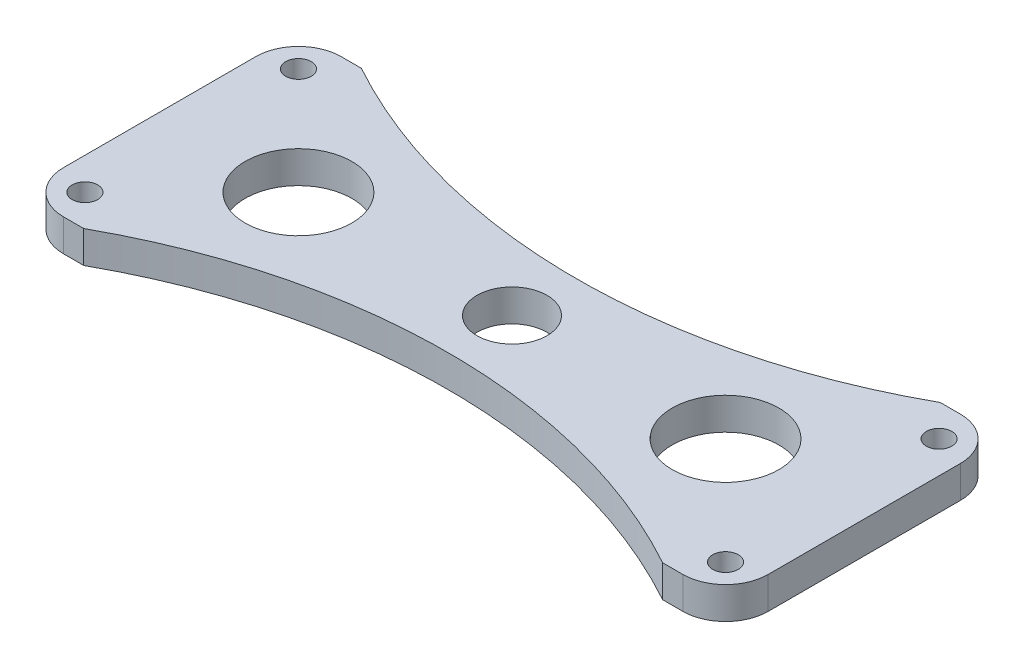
ISO-10303-21;
HEADER;
FILE_DESCRIPTION(('STEP AP214'),'2;1');
FILE_NAME('part.step','',(''),(''),'','','');
FILE_SCHEMA(('AUTOMOTIVE_DESIGN { 1 0 10303 214 1 1 1 1 }'));
ENDSEC;
DATA;
#1=APPLICATION_CONTEXT('core data for automotive mechanical design processes');
#2=APPLICATION_PROTOCOL_DEFINITION('international standard','automotive_design',2000,#1);
#3=PRODUCT_CONTEXT('',#1,'mechanical');
#4=PRODUCT('Part','Part','',(#3));
#5=PRODUCT_RELATED_PRODUCT_CATEGORY('part','',(#4));
#6=PRODUCT_DEFINITION_FORMATION('','',#4);
#7=PRODUCT_DEFINITION_CONTEXT('part definition',#1,'design');
#8=PRODUCT_DEFINITION('design','',#6,#7);
#9=PRODUCT_DEFINITION_SHAPE('','',#8);
#10=(LENGTH_UNIT() NAMED_UNIT(*) SI_UNIT(.MILLI.,.METRE.));
#11=(NAMED_UNIT(*) PLANE_ANGLE_UNIT() SI_UNIT($,.RADIAN.));
#12=(NAMED_UNIT(*) SI_UNIT($,.STERADIAN.) SOLID_ANGLE_UNIT());
#13=UNCERTAINTY_MEASURE_WITH_UNIT(LENGTH_MEASURE(1.E-05),#10,'distance_accuracy_value','');
#14=(GEOMETRIC_REPRESENTATION_CONTEXT(3) GLOBAL_UNCERTAINTY_ASSIGNED_CONTEXT((#13)) GLOBAL_UNIT_ASSIGNED_CONTEXT((#10,
#11,#12)) REPRESENTATION_CONTEXT('',''));
#15=CARTESIAN_POINT('',(0.,0.,0.));
#16=DIRECTION('',(0.,0.,1.));
#17=DIRECTION('',(1.,0.,0.));
#18=AXIS2_PLACEMENT_3D('',#15,#16,#17);
#19=CARTESIAN_POINT('',(-52.3875,4.7625,-20.6375));
#20=DIRECTION('',(0.,0.,1.));
#21=DIRECTION('',(1.,0.,0.));
#22=AXIS2_PLACEMENT_3D('',#19,#20,#21);
#23=PLANE('',#22);
#24=DIRECTION('',(-1.,0.,0.));
#25=VECTOR('',#24,1.);
#26=CARTESIAN_POINT('',(-52.3875,0.,-20.6375));
#27=LINE('',#26,#25);
#28=CARTESIAN_POINT('',(46.0375000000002,0.,-20.6375));
#29=VERTEX_POINT('',#28);
#30=CARTESIAN_POINT('',(43.0385274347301,0.,-20.6375));
#31=VERTEX_POINT('',#30);
#32=EDGE_CURVE('E213',#29,#31,#27,.T.);
#33=ORIENTED_EDGE('',*,*,#32,.T.);
#34=DIRECTION('',(0.,1.,0.));
#35=VECTOR('',#34,1.);
#36=CARTESIAN_POINT('',(43.0385274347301,0.,-20.6375000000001));
#37=LINE('',#36,#35);
#38=CARTESIAN_POINT('',(43.0385274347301,4.7625,-20.6375));
#39=VERTEX_POINT('',#38);
#40=EDGE_CURVE('E13',#31,#39,#37,.T.);
#41=ORIENTED_EDGE('',*,*,#40,.T.);
#42=DIRECTION('',(-1.,0.,0.));
#43=VECTOR('',#42,1.);
#44=CARTESIAN_POINT('',(-52.3875,4.7625,-20.6375));
#45=LINE('',#44,#43);
#46=CARTESIAN_POINT('',(46.0375000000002,4.7625,-20.6375));
#47=VERTEX_POINT('',#46);
#48=EDGE_CURVE('E141',#47,#39,#45,.T.);
#49=ORIENTED_EDGE('',*,*,#48,.F.);
#50=DIRECTION('',(0.,-1.,0.));
#51=VECTOR('',#50,1.);
#52=CARTESIAN_POINT('',(46.0375000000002,4.7625,-20.6375));
#53=LINE('',#52,#51);
#54=EDGE_CURVE('E170',#47,#29,#53,.T.);
#55=ORIENTED_EDGE('',*,*,#54,.T.);
#56=EDGE_LOOP('',(#33,#41,#49,#55));
#57=FACE_BOUND('',#56,.T.);
#58=ADVANCED_FACE('F41',(#57),#23,.F.);
#59=CARTESIAN_POINT('',(-52.3875000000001,4.7625,20.6375));
#60=DIRECTION('',(0.,0.,-1.));
#61=DIRECTION('',(-1.,0.,0.));
#62=AXIS2_PLACEMENT_3D('',#59,#60,#61);
#63=PLANE('',#62);
#64=DIRECTION('',(1.,0.,0.));
#65=VECTOR('',#64,1.);
#66=CARTESIAN_POINT('',(-52.3875000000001,0.,20.6375));
#67=LINE('',#66,#65);
#68=CARTESIAN_POINT('',(-46.0375000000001,0.,20.6375));
#69=VERTEX_POINT('',#68);
#70=CARTESIAN_POINT('',(-43.0385274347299,0.,20.6375));
#71=VERTEX_POINT('',#70);
#72=EDGE_CURVE('E203',#69,#71,#67,.T.);
#73=ORIENTED_EDGE('',*,*,#72,.T.);
#74=DIRECTION('',(0.,1.,0.));
#75=VECTOR('',#74,1.);
#76=CARTESIAN_POINT('',(-43.03852743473,0.,20.6375));
#77=LINE('',#76,#75);
#78=CARTESIAN_POINT('',(-43.0385274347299,4.7625,20.6375));
#79=VERTEX_POINT('',#78);
#80=EDGE_CURVE('E133',#71,#79,#77,.T.);
#81=ORIENTED_EDGE('',*,*,#80,.T.);
#82=DIRECTION('',(1.,0.,0.));
#83=VECTOR('',#82,1.);
#84=CARTESIAN_POINT('',(-52.3875000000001,4.7625,20.6375));
#85=LINE('',#84,#83);
#86=CARTESIAN_POINT('',(-46.0375000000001,4.7625,20.6375));
#87=VERTEX_POINT('',#86);
#88=EDGE_CURVE('E152',#87,#79,#85,.T.);
#89=ORIENTED_EDGE('',*,*,#88,.F.);
#90=DIRECTION('',(0.,-1.,0.));
#91=VECTOR('',#90,1.);
#92=CARTESIAN_POINT('',(-46.0375000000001,4.7625,20.6375));
#93=LINE('',#92,#91);
#94=EDGE_CURVE('E185',#87,#69,#93,.T.);
#95=ORIENTED_EDGE('',*,*,#94,.T.);
#96=EDGE_LOOP('',(#73,#81,#89,#95));
#97=FACE_BOUND('',#96,.T.);
#98=ADVANCED_FACE('F200',(#97),#63,.F.);
#99=CARTESIAN_POINT('',(-52.3875000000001,4.7625,20.6375));
#100=DIRECTION('',(0.,1.,0.));
#101=DIRECTION('',(0.,0.,1.));
#102=AXIS2_PLACEMENT_3D('',#99,#100,#101);
#103=PLANE('',#102);
#104=CARTESIAN_POINT('',(-31.7500000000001,4.7625,0.));
#105=DIRECTION('',(0.,1.,0.));
#106=DIRECTION('',(0.,0.,-1.));
#107=AXIS2_PLACEMENT_3D('',#104,#105,#106);
#108=CIRCLE('',#107,7.9375);
#109=CARTESIAN_POINT('',(-31.7500000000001,4.7625,7.93750000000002));
#110=VERTEX_POINT('',#109);
#111=EDGE_CURVE('E266',#110,#110,#108,.T.);
#112=ORIENTED_EDGE('',*,*,#111,.F.);
#113=EDGE_LOOP('',(#112));
#114=FACE_BOUND('',#113,.T.);
#115=CARTESIAN_POINT('',(31.7500000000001,4.7625,0.));
#116=DIRECTION('',(0.,1.,0.));
#117=DIRECTION('',(0.,0.,1.));
#118=AXIS2_PLACEMENT_3D('',#115,#116,#117);
#119=CIRCLE('',#118,7.9375);
#120=CARTESIAN_POINT('',(31.7500000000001,4.7625,7.93750000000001));
#121=VERTEX_POINT('',#120);
#122=EDGE_CURVE('E260',#121,#121,#119,.T.);
#123=ORIENTED_EDGE('',*,*,#122,.F.);
#124=EDGE_LOOP('',(#123));
#125=FACE_BOUND('',#124,.T.);
#126=CARTESIAN_POINT('',(0.,4.7625,-98.4250000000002));
#127=DIRECTION('',(0.,1.,0.));
#128=DIRECTION('',(0.,0.,-1.));
#129=AXIS2_PLACEMENT_3D('',#126,#127,#128);
#130=CIRCLE('',#129,88.9);
#131=CARTESIAN_POINT('',(-43.0385274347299,4.7625,-20.6375));
#132=VERTEX_POINT('',#131);
#133=EDGE_CURVE('E129',#132,#39,#130,.T.);
#134=ORIENTED_EDGE('',*,*,#133,.F.);
#135=CARTESIAN_POINT('',(-46.0375000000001,4.7625,-20.6375000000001));
#136=VERTEX_POINT('',#135);
#137=EDGE_CURVE('E138',#132,#136,#45,.T.);
#138=ORIENTED_EDGE('',*,*,#137,.T.);
#139=CARTESIAN_POINT('',(-46.0375000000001,4.7625,-14.2875));
#140=DIRECTION('',(0.,1.,0.));
#141=DIRECTION('',(0.,0.,1.));
#142=AXIS2_PLACEMENT_3D('',#139,#140,#141);
#143=CIRCLE('',#142,6.35);
#144=CARTESIAN_POINT('',(-52.3875000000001,4.7625,-14.2875));
#145=VERTEX_POINT('',#144);
#146=EDGE_CURVE('E180',#136,#145,#143,.T.);
#147=ORIENTED_EDGE('',*,*,#146,.T.);
#148=DIRECTION('',(0.,0.,1.));
#149=VECTOR('',#148,1.);
#150=CARTESIAN_POINT('',(-52.3875,4.7625,-20.6375));
#151=LINE('',#150,#149);
#152=CARTESIAN_POINT('',(-52.3875000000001,4.7625,14.2875));
#153=VERTEX_POINT('',#152);
#154=EDGE_CURVE('E210',#145,#153,#151,.T.);
#155=ORIENTED_EDGE('',*,*,#154,.T.);
#156=CARTESIAN_POINT('',(-46.0375000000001,4.7625,14.2875));
#157=DIRECTION('',(0.,1.,0.));
#158=DIRECTION('',(0.,0.,1.));
#159=AXIS2_PLACEMENT_3D('',#156,#157,#158);
#160=CIRCLE('',#159,6.35);
#161=EDGE_CURVE('E178',#153,#87,#160,.T.);
#162=ORIENTED_EDGE('',*,*,#161,.T.);
#163=ORIENTED_EDGE('',*,*,#88,.T.);
#164=CARTESIAN_POINT('',(0.,4.7625,98.4250000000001));
#165=DIRECTION('',(0.,1.,0.));
#166=DIRECTION('',(0.,0.,1.));
#167=AXIS2_PLACEMENT_3D('',#164,#165,#166);
#168=CIRCLE('',#167,88.9);
#169=CARTESIAN_POINT('',(43.03852743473,4.7625,20.6375));
#170=VERTEX_POINT('',#169);
#171=EDGE_CURVE('E205',#170,#79,#168,.T.);
#172=ORIENTED_EDGE('',*,*,#171,.F.);
#173=CARTESIAN_POINT('',(46.0375000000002,4.7625,20.6375000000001));
#174=VERTEX_POINT('',#173);
#175=EDGE_CURVE('E209',#170,#174,#85,.T.);
#176=ORIENTED_EDGE('',*,*,#175,.T.);
#177=CARTESIAN_POINT('',(46.0375000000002,4.7625,14.2875));
#178=DIRECTION('',(0.,1.,0.));
#179=DIRECTION('',(0.,0.,1.));
#180=AXIS2_PLACEMENT_3D('',#177,#178,#179);
#181=CIRCLE('',#180,6.35);
#182=CARTESIAN_POINT('',(52.3875000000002,4.7625,14.2875));
#183=VERTEX_POINT('',#182);
#184=EDGE_CURVE('E174',#174,#183,#181,.T.);
#185=ORIENTED_EDGE('',*,*,#184,.T.);
#186=DIRECTION('',(0.,0.,-1.));
#187=VECTOR('',#186,1.);
#188=CARTESIAN_POINT('',(52.3875000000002,4.7625,-20.6375));
#189=LINE('',#188,#187);
#190=CARTESIAN_POINT('',(52.3875000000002,4.7625,-14.2875));
#191=VERTEX_POINT('',#190);
#192=EDGE_CURVE('E148',#183,#191,#189,.T.);
#193=ORIENTED_EDGE('',*,*,#192,.T.);
#194=CARTESIAN_POINT('',(46.0375000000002,4.7625,-14.2875));
#195=DIRECTION('',(0.,1.,0.));
#196=DIRECTION('',(0.,0.,1.));
#197=AXIS2_PLACEMENT_3D('',#194,#195,#196);
#198=CIRCLE('',#197,6.35);
#199=EDGE_CURVE('E176',#191,#47,#198,.T.);
#200=ORIENTED_EDGE('',*,*,#199,.T.);
#201=ORIENTED_EDGE('',*,*,#48,.T.);
#202=EDGE_LOOP('',(#134,#138,#147,#155,#162,#163,#172,#176,#185,#193,#200,#201));
#203=FACE_BOUND('',#202,.T.);
#204=CARTESIAN_POINT('',(-47.6250000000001,4.7625,-15.875));
#205=DIRECTION('',(0.,1.,0.));
#206=DIRECTION('',(0.,0.,1.));
#207=AXIS2_PLACEMENT_3D('',#204,#205,#206);
#208=CIRCLE('',#207,1.89864999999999);
#209=CARTESIAN_POINT('',(-47.6250000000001,4.7625,-13.97635));
#210=VERTEX_POINT('',#209);
#211=EDGE_CURVE('E252',#210,#210,#208,.T.);
#212=ORIENTED_EDGE('',*,*,#211,.F.);
#213=EDGE_LOOP('',(#212));
#214=FACE_BOUND('',#213,.T.);
#215=CARTESIAN_POINT('',(-47.6250000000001,4.7625,15.875));
#216=DIRECTION('',(0.,1.,0.));
#217=DIRECTION('',(0.,0.,1.));
#218=AXIS2_PLACEMENT_3D('',#215,#216,#217);
#219=CIRCLE('',#218,1.89864999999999);
#220=CARTESIAN_POINT('',(-47.6250000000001,4.7625,17.77365));
#221=VERTEX_POINT('',#220);
#222=EDGE_CURVE('E246',#221,#221,#219,.T.);
#223=ORIENTED_EDGE('',*,*,#222,.F.);
#224=EDGE_LOOP('',(#223));
#225=FACE_BOUND('',#224,.T.);
#226=CARTESIAN_POINT('',(47.6250000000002,4.7625,-15.875));
#227=DIRECTION('',(0.,1.,0.));
#228=DIRECTION('',(0.,0.,1.));
#229=AXIS2_PLACEMENT_3D('',#226,#227,#228);
#230=CIRCLE('',#229,1.89864999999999);
#231=CARTESIAN_POINT('',(47.6250000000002,4.7625,-13.97635));
#232=VERTEX_POINT('',#231);
#233=EDGE_CURVE('E240',#232,#232,#230,.T.);
#234=ORIENTED_EDGE('',*,*,#233,.F.);
#235=EDGE_LOOP('',(#234));
#236=FACE_BOUND('',#235,.T.);
#237=CARTESIAN_POINT('',(47.6250000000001,4.7625,15.875));
#238=DIRECTION('',(0.,1.,0.));
#239=DIRECTION('',(0.,0.,1.));
#240=AXIS2_PLACEMENT_3D('',#237,#238,#239);
#241=CIRCLE('',#240,1.89864999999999);
#242=CARTESIAN_POINT('',(47.6250000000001,4.7625,17.77365));
#243=VERTEX_POINT('',#242);
#244=EDGE_CURVE('E234',#243,#243,#241,.T.);
#245=ORIENTED_EDGE('',*,*,#244,.F.);
#246=EDGE_LOOP('',(#245));
#247=FACE_BOUND('',#246,.T.);
#248=CARTESIAN_POINT('',(0.,4.7625,0.));
#249=DIRECTION('',(0.,1.,0.));
#250=DIRECTION('',(0.,0.,1.));
#251=AXIS2_PLACEMENT_3D('',#248,#249,#250);
#252=CIRCLE('',#251,5.207);
#253=CARTESIAN_POINT('',(0.,4.7625,-5.20700000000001));
#254=VERTEX_POINT('',#253);
#255=EDGE_CURVE('E225',#254,#254,#252,.T.);
#256=ORIENTED_EDGE('',*,*,#255,.F.);
#257=EDGE_LOOP('',(#256));
#258=FACE_BOUND('',#257,.T.);
#259=ADVANCED_FACE('F136',(#114,#125,#203,#214,#225,#236,#247,#258),#103,.T.);
#260=CARTESIAN_POINT('',(-52.3875000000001,0.,20.6375));
#261=DIRECTION('',(0.,1.,0.));
#262=DIRECTION('',(0.,0.,1.));
#263=AXIS2_PLACEMENT_3D('',#260,#261,#262);
#264=PLANE('',#263);
#265=CARTESIAN_POINT('',(-31.7500000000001,0.,0.));
#266=DIRECTION('',(0.,1.,0.));
#267=DIRECTION('',(0.,0.,-1.));
#268=AXIS2_PLACEMENT_3D('',#265,#266,#267);
#269=CIRCLE('',#268,7.9375);
#270=CARTESIAN_POINT('',(-31.7500000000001,0.,7.93750000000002));
#271=VERTEX_POINT('',#270);
#272=EDGE_CURVE('E263',#271,#271,#269,.T.);
#273=ORIENTED_EDGE('',*,*,#272,.T.);
#274=EDGE_LOOP('',(#273));
#275=FACE_BOUND('',#274,.T.);
#276=CARTESIAN_POINT('',(31.7500000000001,0.,0.));
#277=DIRECTION('',(0.,1.,0.));
#278=DIRECTION('',(0.,0.,1.));
#279=AXIS2_PLACEMENT_3D('',#276,#277,#278);
#280=CIRCLE('',#279,7.9375);
#281=CARTESIAN_POINT('',(31.7500000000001,0.,7.93750000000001));
#282=VERTEX_POINT('',#281);
#283=EDGE_CURVE('E142',#282,#282,#280,.T.);
#284=ORIENTED_EDGE('',*,*,#283,.T.);
#285=EDGE_LOOP('',(#284));
#286=FACE_BOUND('',#285,.T.);
#287=CARTESIAN_POINT('',(-47.6250000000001,0.,-15.875));
#288=DIRECTION('',(0.,1.,0.));
#289=DIRECTION('',(0.,0.,1.));
#290=AXIS2_PLACEMENT_3D('',#287,#288,#289);
#291=CIRCLE('',#290,1.89865);
#292=CARTESIAN_POINT('',(-47.6250000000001,0.,-13.97635));
#293=VERTEX_POINT('',#292);
#294=EDGE_CURVE('E249',#293,#293,#291,.T.);
#295=ORIENTED_EDGE('',*,*,#294,.T.);
#296=EDGE_LOOP('',(#295));
#297=FACE_BOUND('',#296,.T.);
#298=CARTESIAN_POINT('',(-47.6250000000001,0.,15.875));
#299=DIRECTION('',(0.,1.,0.));
#300=DIRECTION('',(0.,0.,1.));
#301=AXIS2_PLACEMENT_3D('',#298,#299,#300);
#302=CIRCLE('',#301,1.89865);
#303=CARTESIAN_POINT('',(-47.6250000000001,0.,17.77365));
#304=VERTEX_POINT('',#303);
#305=EDGE_CURVE('E243',#304,#304,#302,.T.);
#306=ORIENTED_EDGE('',*,*,#305,.T.);
#307=EDGE_LOOP('',(#306));
#308=FACE_BOUND('',#307,.T.);
#309=CARTESIAN_POINT('',(47.6250000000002,0.,-15.875));
#310=DIRECTION('',(0.,1.,0.));
#311=DIRECTION('',(0.,0.,1.));
#312=AXIS2_PLACEMENT_3D('',#309,#310,#311);
#313=CIRCLE('',#312,1.89865);
#314=CARTESIAN_POINT('',(47.6250000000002,0.,-13.97635));
#315=VERTEX_POINT('',#314);
#316=EDGE_CURVE('E237',#315,#315,#313,.T.);
#317=ORIENTED_EDGE('',*,*,#316,.T.);
#318=EDGE_LOOP('',(#317));
#319=FACE_BOUND('',#318,.T.);
#320=CARTESIAN_POINT('',(47.6250000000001,0.,15.875));
#321=DIRECTION('',(0.,1.,0.));
#322=DIRECTION('',(0.,0.,1.));
#323=AXIS2_PLACEMENT_3D('',#320,#321,#322);
#324=CIRCLE('',#323,1.89865);
#325=CARTESIAN_POINT('',(47.6250000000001,0.,17.77365));
#326=VERTEX_POINT('',#325);
#327=EDGE_CURVE('E231',#326,#326,#324,.T.);
#328=ORIENTED_EDGE('',*,*,#327,.T.);
#329=EDGE_LOOP('',(#328));
#330=FACE_BOUND('',#329,.T.);
#331=CARTESIAN_POINT('',(-43.0385274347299,0.,-20.6375));
#332=VERTEX_POINT('',#331);
#333=CARTESIAN_POINT('',(-46.0375000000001,0.,-20.6375000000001));
#334=VERTEX_POINT('',#333);
#335=EDGE_CURVE('E216',#332,#334,#27,.T.);
#336=ORIENTED_EDGE('',*,*,#335,.F.);
#337=CARTESIAN_POINT('',(0.,0.,-98.4250000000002));
#338=DIRECTION('',(0.,1.,0.));
#339=DIRECTION('',(0.,0.,-1.));
#340=AXIS2_PLACEMENT_3D('',#337,#338,#339);
#341=CIRCLE('',#340,88.9);
#342=EDGE_CURVE('E56',#332,#31,#341,.T.);
#343=ORIENTED_EDGE('',*,*,#342,.T.);
#344=ORIENTED_EDGE('',*,*,#32,.F.);
#345=CARTESIAN_POINT('',(46.0375000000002,0.,-14.2875));
#346=DIRECTION('',(0.,1.,0.));
#347=DIRECTION('',(0.,0.,1.));
#348=AXIS2_PLACEMENT_3D('',#345,#346,#347);
#349=CIRCLE('',#348,6.35);
#350=CARTESIAN_POINT('',(52.3875000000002,0.,-14.2875));
#351=VERTEX_POINT('',#350);
#352=EDGE_CURVE('E163',#29,#351,#349,.F.);
#353=ORIENTED_EDGE('',*,*,#352,.T.);
#354=DIRECTION('',(0.,0.,-1.));
#355=VECTOR('',#354,1.);
#356=CARTESIAN_POINT('',(52.3875000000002,0.,-20.6375));
#357=LINE('',#356,#355);
#358=CARTESIAN_POINT('',(52.3875000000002,0.,14.2875));
#359=VERTEX_POINT('',#358);
#360=EDGE_CURVE('E217',#359,#351,#357,.T.);
#361=ORIENTED_EDGE('',*,*,#360,.F.);
#362=CARTESIAN_POINT('',(46.0375000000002,0.,14.2875));
#363=DIRECTION('',(0.,1.,0.));
#364=DIRECTION('',(0.,0.,1.));
#365=AXIS2_PLACEMENT_3D('',#362,#363,#364);
#366=CIRCLE('',#365,6.35);
#367=CARTESIAN_POINT('',(46.0375000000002,0.,20.6375000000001));
#368=VERTEX_POINT('',#367);
#369=EDGE_CURVE('E160',#359,#368,#366,.F.);
#370=ORIENTED_EDGE('',*,*,#369,.T.);
#371=CARTESIAN_POINT('',(43.03852743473,0.,20.6375));
#372=VERTEX_POINT('',#371);
#373=EDGE_CURVE('E221',#372,#368,#67,.T.);
#374=ORIENTED_EDGE('',*,*,#373,.F.);
#375=CARTESIAN_POINT('',(0.,0.,98.4250000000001));
#376=DIRECTION('',(0.,1.,0.));
#377=DIRECTION('',(0.,0.,1.));
#378=AXIS2_PLACEMENT_3D('',#375,#376,#377);
#379=CIRCLE('',#378,88.9);
#380=EDGE_CURVE('E64',#372,#71,#379,.T.);
#381=ORIENTED_EDGE('',*,*,#380,.T.);
#382=ORIENTED_EDGE('',*,*,#72,.F.);
#383=CARTESIAN_POINT('',(-46.0375000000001,0.,14.2875));
#384=DIRECTION('',(0.,1.,0.));
#385=DIRECTION('',(0.,0.,1.));
#386=AXIS2_PLACEMENT_3D('',#383,#384,#385);
#387=CIRCLE('',#386,6.35);
#388=CARTESIAN_POINT('',(-52.3875000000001,0.,14.2875));
#389=VERTEX_POINT('',#388);
#390=EDGE_CURVE('E165',#69,#389,#387,.F.);
#391=ORIENTED_EDGE('',*,*,#390,.T.);
#392=DIRECTION('',(0.,0.,1.));
#393=VECTOR('',#392,1.);
#394=CARTESIAN_POINT('',(-52.3875,0.,-20.6375));
#395=LINE('',#394,#393);
#396=CARTESIAN_POINT('',(-52.3875000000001,0.,-14.2875));
#397=VERTEX_POINT('',#396);
#398=EDGE_CURVE('E222',#397,#389,#395,.T.);
#399=ORIENTED_EDGE('',*,*,#398,.F.);
#400=CARTESIAN_POINT('',(-46.0375000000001,0.,-14.2875));
#401=DIRECTION('',(0.,1.,0.));
#402=DIRECTION('',(0.,0.,1.));
#403=AXIS2_PLACEMENT_3D('',#400,#401,#402);
#404=CIRCLE('',#403,6.35);
#405=EDGE_CURVE('E167',#397,#334,#404,.F.);
#406=ORIENTED_EDGE('',*,*,#405,.T.);
#407=EDGE_LOOP('',(#336,#343,#344,#353,#361,#370,#374,#381,#382,#391,#399,#406));
#408=FACE_BOUND('',#407,.T.);
#409=CARTESIAN_POINT('',(0.,0.,0.));
#410=DIRECTION('',(0.,1.,0.));
#411=DIRECTION('',(0.,0.,1.));
#412=AXIS2_PLACEMENT_3D('',#409,#410,#411);
#413=CIRCLE('',#412,5.207);
#414=CARTESIAN_POINT('',(0.,0.,-5.20700000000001));
#415=VERTEX_POINT('',#414);
#416=EDGE_CURVE('E228',#415,#415,#413,.T.);
#417=ORIENTED_EDGE('',*,*,#416,.T.);
#418=EDGE_LOOP('',(#417));
#419=FACE_BOUND('',#418,.T.);
#420=ADVANCED_FACE('F274',(#275,#286,#297,#308,#319,#330,#408,#419),#264,.F.);
#421=CARTESIAN_POINT('',(-52.3875,4.7625,-20.6375));
#422=DIRECTION('',(1.,0.,0.));
#423=DIRECTION('',(0.,0.,-1.));
#424=AXIS2_PLACEMENT_3D('',#421,#422,#423);
#425=PLANE('',#424);
#426=ORIENTED_EDGE('',*,*,#154,.F.);
#427=DIRECTION('',(0.,-1.,0.));
#428=VECTOR('',#427,1.);
#429=CARTESIAN_POINT('',(-52.3875000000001,4.7625,-14.2875));
#430=LINE('',#429,#428);
#431=EDGE_CURVE('E157',#145,#397,#430,.T.);
#432=ORIENTED_EDGE('',*,*,#431,.T.);
#433=ORIENTED_EDGE('',*,*,#398,.T.);
#434=DIRECTION('',(0.,-1.,0.));
#435=VECTOR('',#434,1.);
#436=CARTESIAN_POINT('',(-52.3875000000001,4.7625,14.2875));
#437=LINE('',#436,#435);
#438=EDGE_CURVE('E150',#389,#153,#437,.F.);
#439=ORIENTED_EDGE('',*,*,#438,.T.);
#440=EDGE_LOOP('',(#426,#432,#433,#439));
#441=FACE_BOUND('',#440,.T.);
#442=ADVANCED_FACE('F43',(#441),#425,.F.);
#443=ORIENTED_EDGE('',*,*,#175,.F.);
#444=DIRECTION('',(0.,1.,0.));
#445=VECTOR('',#444,1.);
#446=CARTESIAN_POINT('',(43.0385274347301,0.,20.6375000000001));
#447=LINE('',#446,#445);
#448=EDGE_CURVE('E193',#170,#372,#447,.F.);
#449=ORIENTED_EDGE('',*,*,#448,.T.);
#450=ORIENTED_EDGE('',*,*,#373,.T.);
#451=DIRECTION('',(0.,-1.,0.));
#452=VECTOR('',#451,1.);
#453=CARTESIAN_POINT('',(46.0375000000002,4.7625,20.6375000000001));
#454=LINE('',#453,#452);
#455=EDGE_CURVE('E182',#368,#174,#454,.F.);
#456=ORIENTED_EDGE('',*,*,#455,.T.);
#457=EDGE_LOOP('',(#443,#449,#450,#456));
#458=FACE_BOUND('',#457,.T.);
#459=ADVANCED_FACE('F298',(#458),#63,.F.);
#460=CARTESIAN_POINT('',(52.3875000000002,4.7625,-20.6375));
#461=DIRECTION('',(-1.,0.,0.));
#462=DIRECTION('',(0.,0.,1.));
#463=AXIS2_PLACEMENT_3D('',#460,#461,#462);
#464=PLANE('',#463);
#465=ORIENTED_EDGE('',*,*,#360,.T.);
#466=DIRECTION('',(0.,-1.,0.));
#467=VECTOR('',#466,1.);
#468=CARTESIAN_POINT('',(52.3875000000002,4.7625,-14.2875));
#469=LINE('',#468,#467);
#470=EDGE_CURVE('E191',#351,#191,#469,.F.);
#471=ORIENTED_EDGE('',*,*,#470,.T.);
#472=ORIENTED_EDGE('',*,*,#192,.F.);
#473=DIRECTION('',(0.,-1.,0.));
#474=VECTOR('',#473,1.);
#475=CARTESIAN_POINT('',(52.3875000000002,4.7625,14.2875));
#476=LINE('',#475,#474);
#477=EDGE_CURVE('E188',#183,#359,#476,.T.);
#478=ORIENTED_EDGE('',*,*,#477,.T.);
#479=EDGE_LOOP('',(#465,#471,#472,#478));
#480=FACE_BOUND('',#479,.T.);
#481=ADVANCED_FACE('F302',(#480),#464,.F.);
#482=ORIENTED_EDGE('',*,*,#137,.F.);
#483=DIRECTION('',(0.,1.,0.));
#484=VECTOR('',#483,1.);
#485=CARTESIAN_POINT('',(-43.03852743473,0.,-20.6375000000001));
#486=LINE('',#485,#484);
#487=EDGE_CURVE('E49',#132,#332,#486,.F.);
#488=ORIENTED_EDGE('',*,*,#487,.T.);
#489=ORIENTED_EDGE('',*,*,#335,.T.);
#490=DIRECTION('',(0.,-1.,0.));
#491=VECTOR('',#490,1.);
#492=CARTESIAN_POINT('',(-46.0375000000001,4.7625,-20.6375000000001));
#493=LINE('',#492,#491);
#494=EDGE_CURVE('E146',#334,#136,#493,.F.);
#495=ORIENTED_EDGE('',*,*,#494,.T.);
#496=EDGE_LOOP('',(#482,#488,#489,#495));
#497=FACE_BOUND('',#496,.T.);
#498=ADVANCED_FACE('F144',(#497),#23,.F.);
#499=CARTESIAN_POINT('',(0.,4.7625,0.));
#500=DIRECTION('',(0.,-1.,0.));
#501=DIRECTION('',(0.,0.,-1.));
#502=AXIS2_PLACEMENT_3D('',#499,#500,#501);
#503=CYLINDRICAL_SURFACE('',#502,5.207);
#504=CARTESIAN_POINT('',(0.,4.7625,-5.20700000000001));
#505=CARTESIAN_POINT('',(0.,4.712890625,-5.20700000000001));
#506=CARTESIAN_POINT('',(0.,4.66328125,-5.20700000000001));
#507=CARTESIAN_POINT('',(0.,4.5640625,-5.20700000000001));
#508=CARTESIAN_POINT('',(0.,4.514453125,-5.20700000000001));
#509=CARTESIAN_POINT('',(0.,4.415234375,-5.20700000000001));
#510=CARTESIAN_POINT('',(0.,4.365625,-5.20700000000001));
#511=CARTESIAN_POINT('',(0.,4.26640625,-5.20700000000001));
#512=CARTESIAN_POINT('',(0.,4.216796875,-5.20700000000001));
#513=CARTESIAN_POINT('',(0.,4.117578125,-5.20700000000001));
#514=CARTESIAN_POINT('',(0.,4.06796875,-5.20700000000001));
#515=CARTESIAN_POINT('',(0.,3.96875,-5.20700000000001));
#516=CARTESIAN_POINT('',(0.,3.919140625,-5.20700000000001));
#517=CARTESIAN_POINT('',(0.,3.819921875,-5.20700000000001));
#518=CARTESIAN_POINT('',(0.,3.7703125,-5.20700000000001));
#519=CARTESIAN_POINT('',(0.,3.67109375,-5.20700000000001));
#520=CARTESIAN_POINT('',(0.,3.621484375,-5.20700000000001));
#521=CARTESIAN_POINT('',(0.,3.522265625,-5.20700000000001));
#522=CARTESIAN_POINT('',(0.,3.47265625,-5.20700000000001));
#523=CARTESIAN_POINT('',(0.,3.3734375,-5.20700000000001));
#524=CARTESIAN_POINT('',(0.,3.323828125,-5.20700000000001));
#525=CARTESIAN_POINT('',(0.,3.224609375,-5.20700000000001));
#526=CARTESIAN_POINT('',(0.,3.175,-5.20700000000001));
#527=CARTESIAN_POINT('',(0.,3.07578125,-5.20700000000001));
#528=CARTESIAN_POINT('',(0.,3.026171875,-5.20700000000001));
#529=CARTESIAN_POINT('',(0.,2.926953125,-5.20700000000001));
#530=CARTESIAN_POINT('',(0.,2.87734375,-5.20700000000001));
#531=CARTESIAN_POINT('',(0.,2.778125,-5.20700000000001));
#532=CARTESIAN_POINT('',(0.,2.728515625,-5.20700000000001));
#533=CARTESIAN_POINT('',(0.,2.629296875,-5.20700000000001));
#534=CARTESIAN_POINT('',(0.,2.5796875,-5.20700000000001));
#535=CARTESIAN_POINT('',(0.,2.48046875,-5.20700000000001));
#536=CARTESIAN_POINT('',(0.,2.430859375,-5.20700000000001));
#537=CARTESIAN_POINT('',(0.,2.331640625,-5.20700000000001));
#538=CARTESIAN_POINT('',(0.,2.28203125,-5.20700000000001));
#539=CARTESIAN_POINT('',(0.,2.1828125,-5.20700000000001));
#540=CARTESIAN_POINT('',(0.,2.133203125,-5.20700000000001));
#541=CARTESIAN_POINT('',(0.,2.033984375,-5.20700000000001));
#542=CARTESIAN_POINT('',(0.,1.984375,-5.20700000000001));
#543=CARTESIAN_POINT('',(0.,1.88515625,-5.20700000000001));
#544=CARTESIAN_POINT('',(0.,1.835546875,-5.20700000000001));
#545=CARTESIAN_POINT('',(0.,1.736328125,-5.20700000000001));
#546=CARTESIAN_POINT('',(0.,1.68671875,-5.20700000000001));
#547=CARTESIAN_POINT('',(0.,1.5875,-5.20700000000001));
#548=CARTESIAN_POINT('',(0.,1.537890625,-5.20700000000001));
#549=CARTESIAN_POINT('',(0.,1.438671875,-5.20700000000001));
#550=CARTESIAN_POINT('',(0.,1.3890625,-5.20700000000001));
#551=CARTESIAN_POINT('',(0.,1.28984375,-5.20700000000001));
#552=CARTESIAN_POINT('',(0.,1.240234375,-5.20700000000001));
#553=CARTESIAN_POINT('',(0.,1.141015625,-5.20700000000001));
#554=CARTESIAN_POINT('',(0.,1.09140625,-5.20700000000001));
#555=CARTESIAN_POINT('',(0.,0.9921875,-5.20700000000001));
#556=CARTESIAN_POINT('',(0.,0.942578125,-5.20700000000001));
#557=CARTESIAN_POINT('',(0.,0.843359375,-5.20700000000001));
#558=CARTESIAN_POINT('',(0.,0.79375,-5.20700000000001));
#559=CARTESIAN_POINT('',(0.,0.694531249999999,-5.20700000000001));
#560=CARTESIAN_POINT('',(0.,0.644921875,-5.20700000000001));
#561=CARTESIAN_POINT('',(0.,0.545703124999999,-5.20700000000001));
#562=CARTESIAN_POINT('',(0.,0.496093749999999,-5.20700000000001));
#563=CARTESIAN_POINT('',(0.,0.396874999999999,-5.20700000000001));
#564=CARTESIAN_POINT('',(0.,0.347265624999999,-5.20700000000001));
#565=CARTESIAN_POINT('',(0.,0.248046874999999,-5.20700000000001));
#566=CARTESIAN_POINT('',(0.,0.198437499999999,-5.20700000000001));
#567=CARTESIAN_POINT('',(0.,0.0992187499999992,-5.20700000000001));
#568=CARTESIAN_POINT('',(0.,0.0496093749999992,-5.20700000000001));
#569=CARTESIAN_POINT('',(0.,0.,-5.20700000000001));
#570=B_SPLINE_CURVE_WITH_KNOTS('',3,(#504,#505,#506,#507,#508,#509,#510,#511,#512,#513,#514,
#515,#516,#517,#518,#519,#520,#521,#522,#523,#524,#525,#526,#527,#528,#529,#530,#531,#532,#533,
#534,#535,#536,#537,#538,#539,#540,#541,#542,#543,#544,#545,#546,#547,#548,#549,#550,#551,#552,
#553,#554,#555,#556,#557,#558,#559,#560,#561,#562,#563,#564,#565,#566,#567,#568,#569),
.UNSPECIFIED.,.F.,.F.,(4,2,2,2,2,2,2,2,2,2,2,2,2,2,2,2,2,2,2,2,2,2,2,2,2,2,2,2,2,2,2,2,4),(0.,
0.148828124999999,0.297656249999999,0.446484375,0.595312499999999,0.744140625,0.89296875,
1.041796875,1.190625,1.339453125,1.48828125,1.637109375,1.7859375,1.934765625,2.08359375,
2.232421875,2.38125,2.530078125,2.67890625,2.827734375,2.9765625,3.125390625,3.27421875,
3.423046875,3.571875,3.720703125,3.86953125,4.018359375,4.1671875,4.316015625,4.46484375,
4.613671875,4.7625),.UNSPECIFIED.);
#571=EDGE_CURVE('BSEAM301',#254,#415,#570,.T.);
#572=ORIENTED_EDGE('',*,*,#255,.T.);
#573=ORIENTED_EDGE('',*,*,#416,.F.);
#574=ORIENTED_EDGE('',*,*,#571,.T.);
#575=ORIENTED_EDGE('',*,*,#571,.F.);
#576=EDGE_LOOP('',(#572,#574,#573,#575));
#577=FACE_BOUND('',#576,.T.);
#578=ADVANCED_FACE('F301',(#577),#503,.F.);
#579=CARTESIAN_POINT('',(47.6250000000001,4.7625,15.875));
#580=DIRECTION('',(0.,1.,0.));
#581=DIRECTION('',(0.,0.,1.));
#582=AXIS2_PLACEMENT_3D('',#579,#580,#581);
#583=CYLINDRICAL_SURFACE('',#582,1.89864999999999);
#584=ORIENTED_EDGE('',*,*,#327,.F.);
#585=EDGE_LOOP('',(#584));
#586=FACE_BOUND('',#585,.T.);
#587=ORIENTED_EDGE('',*,*,#244,.T.);
#588=EDGE_LOOP('',(#587));
#589=FACE_BOUND('',#588,.T.);
#590=ADVANCED_FACE('F307',(#586,#589),#583,.F.);
#591=CARTESIAN_POINT('',(47.6250000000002,4.7625,-15.875));
#592=DIRECTION('',(0.,1.,0.));
#593=DIRECTION('',(0.,0.,1.));
#594=AXIS2_PLACEMENT_3D('',#591,#592,#593);
#595=CYLINDRICAL_SURFACE('',#594,1.89864999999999);
#596=ORIENTED_EDGE('',*,*,#316,.F.);
#597=EDGE_LOOP('',(#596));
#598=FACE_BOUND('',#597,.T.);
#599=ORIENTED_EDGE('',*,*,#233,.T.);
#600=EDGE_LOOP('',(#599));
#601=FACE_BOUND('',#600,.T.);
#602=ADVANCED_FACE('F359',(#598,#601),#595,.F.);
#603=CARTESIAN_POINT('',(-47.6250000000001,4.7625,15.875));
#604=DIRECTION('',(0.,1.,0.));
#605=DIRECTION('',(0.,0.,1.));
#606=AXIS2_PLACEMENT_3D('',#603,#604,#605);
#607=CYLINDRICAL_SURFACE('',#606,1.89864999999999);
#608=ORIENTED_EDGE('',*,*,#305,.F.);
#609=EDGE_LOOP('',(#608));
#610=FACE_BOUND('',#609,.T.);
#611=ORIENTED_EDGE('',*,*,#222,.T.);
#612=EDGE_LOOP('',(#611));
#613=FACE_BOUND('',#612,.T.);
#614=ADVANCED_FACE('F355',(#610,#613),#607,.F.);
#615=CARTESIAN_POINT('',(-47.6250000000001,4.7625,-15.875));
#616=DIRECTION('',(0.,1.,0.));
#617=DIRECTION('',(0.,0.,1.));
#618=AXIS2_PLACEMENT_3D('',#615,#616,#617);
#619=CYLINDRICAL_SURFACE('',#618,1.89864999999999);
#620=ORIENTED_EDGE('',*,*,#294,.F.);
#621=EDGE_LOOP('',(#620));
#622=FACE_BOUND('',#621,.T.);
#623=ORIENTED_EDGE('',*,*,#211,.T.);
#624=EDGE_LOOP('',(#623));
#625=FACE_BOUND('',#624,.T.);
#626=ADVANCED_FACE('F352',(#622,#625),#619,.F.);
#627=CARTESIAN_POINT('',(-46.0375000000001,4.7625,-14.2875));
#628=DIRECTION('',(0.,-1.,0.));
#629=DIRECTION('',(0.,0.,-1.));
#630=AXIS2_PLACEMENT_3D('',#627,#628,#629);
#631=CYLINDRICAL_SURFACE('',#630,6.35);
#632=ORIENTED_EDGE('',*,*,#146,.F.);
#633=ORIENTED_EDGE('',*,*,#494,.F.);
#634=ORIENTED_EDGE('',*,*,#405,.F.);
#635=ORIENTED_EDGE('',*,*,#431,.F.);
#636=EDGE_LOOP('',(#632,#633,#634,#635));
#637=FACE_BOUND('',#636,.T.);
#638=ADVANCED_FACE('F329',(#637),#631,.T.);
#639=CARTESIAN_POINT('',(-46.0375000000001,4.7625,14.2875));
#640=DIRECTION('',(0.,-1.,0.));
#641=DIRECTION('',(0.,0.,-1.));
#642=AXIS2_PLACEMENT_3D('',#639,#640,#641);
#643=CYLINDRICAL_SURFACE('',#642,6.35);
#644=ORIENTED_EDGE('',*,*,#161,.F.);
#645=ORIENTED_EDGE('',*,*,#438,.F.);
#646=ORIENTED_EDGE('',*,*,#390,.F.);
#647=ORIENTED_EDGE('',*,*,#94,.F.);
#648=EDGE_LOOP('',(#644,#645,#646,#647));
#649=FACE_BOUND('',#648,.T.);
#650=ADVANCED_FACE('F334',(#649),#643,.T.);
#651=CARTESIAN_POINT('',(46.0375000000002,4.7625,-14.2875));
#652=DIRECTION('',(0.,-1.,0.));
#653=DIRECTION('',(0.,0.,-1.));
#654=AXIS2_PLACEMENT_3D('',#651,#652,#653);
#655=CYLINDRICAL_SURFACE('',#654,6.35);
#656=ORIENTED_EDGE('',*,*,#199,.F.);
#657=ORIENTED_EDGE('',*,*,#470,.F.);
#658=ORIENTED_EDGE('',*,*,#352,.F.);
#659=ORIENTED_EDGE('',*,*,#54,.F.);
#660=EDGE_LOOP('',(#656,#657,#658,#659));
#661=FACE_BOUND('',#660,.T.);
#662=ADVANCED_FACE('F322',(#661),#655,.T.);
#663=CARTESIAN_POINT('',(46.0375000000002,4.7625,14.2875));
#664=DIRECTION('',(0.,-1.,0.));
#665=DIRECTION('',(0.,0.,-1.));
#666=AXIS2_PLACEMENT_3D('',#663,#664,#665);
#667=CYLINDRICAL_SURFACE('',#666,6.35);
#668=ORIENTED_EDGE('',*,*,#184,.F.);
#669=ORIENTED_EDGE('',*,*,#455,.F.);
#670=ORIENTED_EDGE('',*,*,#369,.F.);
#671=ORIENTED_EDGE('',*,*,#477,.F.);
#672=EDGE_LOOP('',(#668,#669,#670,#671));
#673=FACE_BOUND('',#672,.T.);
#674=ADVANCED_FACE('F338',(#673),#667,.T.);
#675=CARTESIAN_POINT('',(0.,0.,98.4250000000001));
#676=DIRECTION('',(0.,1.,0.));
#677=DIRECTION('',(0.,0.,1.));
#678=AXIS2_PLACEMENT_3D('',#675,#676,#677);
#679=CYLINDRICAL_SURFACE('',#678,88.9);
#680=ORIENTED_EDGE('',*,*,#380,.F.);
#681=ORIENTED_EDGE('',*,*,#448,.F.);
#682=ORIENTED_EDGE('',*,*,#171,.T.);
#683=ORIENTED_EDGE('',*,*,#80,.F.);
#684=EDGE_LOOP('',(#680,#681,#682,#683));
#685=FACE_BOUND('',#684,.T.);
#686=ADVANCED_FACE('F288',(#685),#679,.F.);
#687=CARTESIAN_POINT('',(0.,0.,-98.4250000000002));
#688=DIRECTION('',(0.,1.,0.));
#689=DIRECTION('',(0.,0.,1.));
#690=AXIS2_PLACEMENT_3D('',#687,#688,#689);
#691=CYLINDRICAL_SURFACE('',#690,88.9);
#692=ORIENTED_EDGE('',*,*,#342,.F.);
#693=ORIENTED_EDGE('',*,*,#487,.F.);
#694=ORIENTED_EDGE('',*,*,#133,.T.);
#695=ORIENTED_EDGE('',*,*,#40,.F.);
#696=EDGE_LOOP('',(#692,#693,#694,#695));
#697=FACE_BOUND('',#696,.T.);
#698=ADVANCED_FACE('F128',(#697),#691,.F.);
#699=CARTESIAN_POINT('',(31.7500000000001,0.,0.));
#700=DIRECTION('',(0.,1.,0.));
#701=DIRECTION('',(0.,0.,1.));
#702=AXIS2_PLACEMENT_3D('',#699,#700,#701);
#703=CYLINDRICAL_SURFACE('',#702,7.9375);
#704=CARTESIAN_POINT('',(31.7500000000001,0.,7.93750000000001));
#705=CARTESIAN_POINT('',(31.7500000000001,0.0496093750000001,7.93750000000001));
#706=CARTESIAN_POINT('',(31.7500000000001,0.0992187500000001,7.93750000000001));
#707=CARTESIAN_POINT('',(31.7500000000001,0.1984375,7.93750000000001));
#708=CARTESIAN_POINT('',(31.7500000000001,0.248046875,7.93750000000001));
#709=CARTESIAN_POINT('',(31.7500000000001,0.347265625,7.93750000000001));
#710=CARTESIAN_POINT('',(31.7500000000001,0.396875,7.93750000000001));
#711=CARTESIAN_POINT('',(31.7500000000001,0.49609375,7.93750000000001));
#712=CARTESIAN_POINT('',(31.7500000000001,0.545703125,7.93750000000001));
#713=CARTESIAN_POINT('',(31.7500000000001,0.644921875,7.93750000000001));
#714=CARTESIAN_POINT('',(31.7500000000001,0.69453125,7.93750000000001));
#715=CARTESIAN_POINT('',(31.7500000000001,0.79375,7.93750000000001));
#716=CARTESIAN_POINT('',(31.7500000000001,0.843359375,7.93750000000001));
#717=CARTESIAN_POINT('',(31.7500000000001,0.942578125,7.93750000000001));
#718=CARTESIAN_POINT('',(31.7500000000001,0.9921875,7.93750000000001));
#719=CARTESIAN_POINT('',(31.7500000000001,1.09140625,7.93750000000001));
#720=CARTESIAN_POINT('',(31.7500000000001,1.141015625,7.93750000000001));
#721=CARTESIAN_POINT('',(31.7500000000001,1.240234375,7.93750000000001));
#722=CARTESIAN_POINT('',(31.7500000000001,1.28984375,7.93750000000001));
#723=CARTESIAN_POINT('',(31.7500000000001,1.3890625,7.93750000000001));
#724=CARTESIAN_POINT('',(31.7500000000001,1.438671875,7.93750000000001));
#725=CARTESIAN_POINT('',(31.7500000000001,1.537890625,7.93750000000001));
#726=CARTESIAN_POINT('',(31.7500000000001,1.5875,7.93750000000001));
#727=CARTESIAN_POINT('',(31.7500000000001,1.68671875,7.93750000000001));
#728=CARTESIAN_POINT('',(31.7500000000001,1.736328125,7.93750000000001));
#729=CARTESIAN_POINT('',(31.7500000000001,1.835546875,7.93750000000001));
#730=CARTESIAN_POINT('',(31.7500000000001,1.88515625,7.93750000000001));
#731=CARTESIAN_POINT('',(31.7500000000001,1.984375,7.93750000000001));
#732=CARTESIAN_POINT('',(31.7500000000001,2.033984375,7.93750000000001));
#733=CARTESIAN_POINT('',(31.7500000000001,2.133203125,7.93750000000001));
#734=CARTESIAN_POINT('',(31.7500000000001,2.1828125,7.93750000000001));
#735=CARTESIAN_POINT('',(31.7500000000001,2.28203125,7.93750000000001));
#736=CARTESIAN_POINT('',(31.7500000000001,2.331640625,7.93750000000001));
#737=CARTESIAN_POINT('',(31.7500000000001,2.430859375,7.93750000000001));
#738=CARTESIAN_POINT('',(31.7500000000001,2.48046875,7.93750000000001));
#739=CARTESIAN_POINT('',(31.7500000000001,2.5796875,7.93750000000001));
#740=CARTESIAN_POINT('',(31.7500000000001,2.629296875,7.93750000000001));
#741=CARTESIAN_POINT('',(31.7500000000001,2.728515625,7.93750000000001));
#742=CARTESIAN_POINT('',(31.7500000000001,2.778125,7.93750000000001));
#743=CARTESIAN_POINT('',(31.7500000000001,2.87734375,7.93750000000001));
#744=CARTESIAN_POINT('',(31.7500000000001,2.926953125,7.93750000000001));
#745=CARTESIAN_POINT('',(31.7500000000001,3.026171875,7.93750000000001));
#746=CARTESIAN_POINT('',(31.7500000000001,3.07578125,7.93750000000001));
#747=CARTESIAN_POINT('',(31.7500000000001,3.175,7.93750000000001));
#748=CARTESIAN_POINT('',(31.7500000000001,3.224609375,7.93750000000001));
#749=CARTESIAN_POINT('',(31.7500000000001,3.323828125,7.93750000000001));
#750=CARTESIAN_POINT('',(31.7500000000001,3.3734375,7.93750000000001));
#751=CARTESIAN_POINT('',(31.7500000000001,3.47265625,7.93750000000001));
#752=CARTESIAN_POINT('',(31.7500000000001,3.522265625,7.93750000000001));
#753=CARTESIAN_POINT('',(31.7500000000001,3.621484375,7.93750000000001));
#754=CARTESIAN_POINT('',(31.7500000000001,3.67109375,7.93750000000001));
#755=CARTESIAN_POINT('',(31.7500000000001,3.7703125,7.93750000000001));
#756=CARTESIAN_POINT('',(31.7500000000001,3.819921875,7.93750000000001));
#757=CARTESIAN_POINT('',(31.7500000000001,3.919140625,7.93750000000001));
#758=CARTESIAN_POINT('',(31.7500000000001,3.96875,7.93750000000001));
#759=CARTESIAN_POINT('',(31.7500000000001,4.06796875,7.93750000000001));
#760=CARTESIAN_POINT('',(31.7500000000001,4.117578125,7.93750000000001));
#761=CARTESIAN_POINT('',(31.7500000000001,4.216796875,7.93750000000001));
#762=CARTESIAN_POINT('',(31.7500000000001,4.26640625,7.93750000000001));
#763=CARTESIAN_POINT('',(31.7500000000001,4.365625,7.93750000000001));
#764=CARTESIAN_POINT('',(31.7500000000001,4.415234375,7.93750000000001));
#765=CARTESIAN_POINT('',(31.7500000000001,4.514453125,7.93750000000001));
#766=CARTESIAN_POINT('',(31.7500000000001,4.5640625,7.93750000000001));
#767=CARTESIAN_POINT('',(31.7500000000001,4.66328125,7.93750000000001));
#768=CARTESIAN_POINT('',(31.7500000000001,4.712890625,7.93750000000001));
#769=CARTESIAN_POINT('',(31.7500000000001,4.7625,7.93750000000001));
#770=B_SPLINE_CURVE_WITH_KNOTS('',3,(#704,#705,#706,#707,#708,#709,#710,#711,#712,#713,#714,
#715,#716,#717,#718,#719,#720,#721,#722,#723,#724,#725,#726,#727,#728,#729,#730,#731,#732,#733,
#734,#735,#736,#737,#738,#739,#740,#741,#742,#743,#744,#745,#746,#747,#748,#749,#750,#751,#752,
#753,#754,#755,#756,#757,#758,#759,#760,#761,#762,#763,#764,#765,#766,#767,#768,#769),
.UNSPECIFIED.,.F.,.F.,(4,2,2,2,2,2,2,2,2,2,2,2,2,2,2,2,2,2,2,2,2,2,2,2,2,2,2,2,2,2,2,2,4),(0.,
0.148828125,0.29765625,0.446484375,0.5953125,0.744140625,0.89296875,1.041796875,1.190625,
1.339453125,1.48828125,1.637109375,1.7859375,1.934765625,2.08359375,2.232421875,2.38125,
2.530078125,2.67890625,2.827734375,2.9765625,3.125390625,3.27421875,3.423046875,3.571875,
3.720703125,3.86953125,4.018359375,4.1671875,4.316015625,4.46484375,4.613671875,4.7625),.UNSPECIFIED.);
#771=EDGE_CURVE('BSEAM278',#282,#121,#770,.T.);
#772=ORIENTED_EDGE('',*,*,#283,.F.);
#773=ORIENTED_EDGE('',*,*,#122,.T.);
#774=ORIENTED_EDGE('',*,*,#771,.T.);
#775=ORIENTED_EDGE('',*,*,#771,.F.);
#776=EDGE_LOOP('',(#772,#774,#773,#775));
#777=FACE_BOUND('',#776,.T.);
#778=ADVANCED_FACE('F278',(#777),#703,.F.);
#779=CARTESIAN_POINT('',(-31.7500000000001,0.,0.));
#780=DIRECTION('',(0.,1.,0.));
#781=DIRECTION('',(0.,0.,1.));
#782=AXIS2_PLACEMENT_3D('',#779,#780,#781);
#783=CYLINDRICAL_SURFACE('',#782,7.9375);
#784=CARTESIAN_POINT('',(-31.7500000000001,0.,7.93750000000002));
#785=CARTESIAN_POINT('',(-31.7500000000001,0.0496093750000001,7.93750000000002));
#786=CARTESIAN_POINT('',(-31.7500000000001,0.0992187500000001,7.93750000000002));
#787=CARTESIAN_POINT('',(-31.7500000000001,0.1984375,7.93750000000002));
#788=CARTESIAN_POINT('',(-31.7500000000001,0.248046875,7.93750000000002));
#789=CARTESIAN_POINT('',(-31.7500000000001,0.347265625,7.93750000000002));
#790=CARTESIAN_POINT('',(-31.7500000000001,0.396875,7.93750000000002));
#791=CARTESIAN_POINT('',(-31.7500000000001,0.49609375,7.93750000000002));
#792=CARTESIAN_POINT('',(-31.7500000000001,0.545703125,7.93750000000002));
#793=CARTESIAN_POINT('',(-31.7500000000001,0.644921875,7.93750000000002));
#794=CARTESIAN_POINT('',(-31.7500000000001,0.69453125,7.93750000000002));
#795=CARTESIAN_POINT('',(-31.7500000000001,0.79375,7.93750000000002));
#796=CARTESIAN_POINT('',(-31.7500000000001,0.843359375,7.93750000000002));
#797=CARTESIAN_POINT('',(-31.7500000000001,0.942578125,7.93750000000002));
#798=CARTESIAN_POINT('',(-31.7500000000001,0.9921875,7.93750000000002));
#799=CARTESIAN_POINT('',(-31.7500000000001,1.09140625,7.93750000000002));
#800=CARTESIAN_POINT('',(-31.7500000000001,1.141015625,7.93750000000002));
#801=CARTESIAN_POINT('',(-31.7500000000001,1.240234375,7.93750000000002));
#802=CARTESIAN_POINT('',(-31.7500000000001,1.28984375,7.93750000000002));
#803=CARTESIAN_POINT('',(-31.7500000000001,1.3890625,7.93750000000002));
#804=CARTESIAN_POINT('',(-31.7500000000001,1.438671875,7.93750000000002));
#805=CARTESIAN_POINT('',(-31.7500000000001,1.537890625,7.93750000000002));
#806=CARTESIAN_POINT('',(-31.7500000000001,1.5875,7.93750000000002));
#807=CARTESIAN_POINT('',(-31.7500000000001,1.68671875,7.93750000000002));
#808=CARTESIAN_POINT('',(-31.7500000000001,1.736328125,7.93750000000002));
#809=CARTESIAN_POINT('',(-31.7500000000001,1.835546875,7.93750000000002));
#810=CARTESIAN_POINT('',(-31.7500000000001,1.88515625,7.93750000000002));
#811=CARTESIAN_POINT('',(-31.7500000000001,1.984375,7.93750000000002));
#812=CARTESIAN_POINT('',(-31.7500000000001,2.033984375,7.93750000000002));
#813=CARTESIAN_POINT('',(-31.7500000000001,2.133203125,7.93750000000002));
#814=CARTESIAN_POINT('',(-31.7500000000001,2.1828125,7.93750000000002));
#815=CARTESIAN_POINT('',(-31.7500000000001,2.28203125,7.93750000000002));
#816=CARTESIAN_POINT('',(-31.7500000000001,2.331640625,7.93750000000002));
#817=CARTESIAN_POINT('',(-31.7500000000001,2.430859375,7.93750000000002));
#818=CARTESIAN_POINT('',(-31.7500000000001,2.48046875,7.93750000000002));
#819=CARTESIAN_POINT('',(-31.7500000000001,2.5796875,7.93750000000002));
#820=CARTESIAN_POINT('',(-31.7500000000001,2.629296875,7.93750000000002));
#821=CARTESIAN_POINT('',(-31.7500000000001,2.728515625,7.93750000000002));
#822=CARTESIAN_POINT('',(-31.7500000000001,2.778125,7.93750000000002));
#823=CARTESIAN_POINT('',(-31.7500000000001,2.87734375,7.93750000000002));
#824=CARTESIAN_POINT('',(-31.7500000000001,2.926953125,7.93750000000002));
#825=CARTESIAN_POINT('',(-31.7500000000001,3.026171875,7.93750000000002));
#826=CARTESIAN_POINT('',(-31.7500000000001,3.07578125,7.93750000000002));
#827=CARTESIAN_POINT('',(-31.7500000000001,3.175,7.93750000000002));
#828=CARTESIAN_POINT('',(-31.7500000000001,3.224609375,7.93750000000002));
#829=CARTESIAN_POINT('',(-31.7500000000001,3.323828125,7.93750000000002));
#830=CARTESIAN_POINT('',(-31.7500000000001,3.3734375,7.93750000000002));
#831=CARTESIAN_POINT('',(-31.7500000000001,3.47265625,7.93750000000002));
#832=CARTESIAN_POINT('',(-31.7500000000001,3.522265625,7.93750000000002));
#833=CARTESIAN_POINT('',(-31.7500000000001,3.621484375,7.93750000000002));
#834=CARTESIAN_POINT('',(-31.7500000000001,3.67109375,7.93750000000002));
#835=CARTESIAN_POINT('',(-31.7500000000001,3.7703125,7.93750000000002));
#836=CARTESIAN_POINT('',(-31.7500000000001,3.819921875,7.93750000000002));
#837=CARTESIAN_POINT('',(-31.7500000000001,3.919140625,7.93750000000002));
#838=CARTESIAN_POINT('',(-31.7500000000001,3.96875,7.93750000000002));
#839=CARTESIAN_POINT('',(-31.7500000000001,4.06796875,7.93750000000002));
#840=CARTESIAN_POINT('',(-31.7500000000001,4.117578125,7.93750000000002));
#841=CARTESIAN_POINT('',(-31.7500000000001,4.216796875,7.93750000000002));
#842=CARTESIAN_POINT('',(-31.7500000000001,4.26640625,7.93750000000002));
#843=CARTESIAN_POINT('',(-31.7500000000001,4.365625,7.93750000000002));
#844=CARTESIAN_POINT('',(-31.7500000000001,4.415234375,7.93750000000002));
#845=CARTESIAN_POINT('',(-31.7500000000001,4.514453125,7.93750000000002));
#846=CARTESIAN_POINT('',(-31.7500000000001,4.5640625,7.93750000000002));
#847=CARTESIAN_POINT('',(-31.7500000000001,4.66328125,7.93750000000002));
#848=CARTESIAN_POINT('',(-31.7500000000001,4.712890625,7.93750000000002));
#849=CARTESIAN_POINT('',(-31.7500000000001,4.7625,7.93750000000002));
#850=B_SPLINE_CURVE_WITH_KNOTS('',3,(#784,#785,#786,#787,#788,#789,#790,#791,#792,#793,#794,
#795,#796,#797,#798,#799,#800,#801,#802,#803,#804,#805,#806,#807,#808,#809,#810,#811,#812,#813,
#814,#815,#816,#817,#818,#819,#820,#821,#822,#823,#824,#825,#826,#827,#828,#829,#830,#831,#832,
#833,#834,#835,#836,#837,#838,#839,#840,#841,#842,#843,#844,#845,#846,#847,#848,#849),
.UNSPECIFIED.,.F.,.F.,(4,2,2,2,2,2,2,2,2,2,2,2,2,2,2,2,2,2,2,2,2,2,2,2,2,2,2,2,2,2,2,2,4),(0.,
0.148828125,0.29765625,0.446484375,0.5953125,0.744140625,0.89296875,1.041796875,1.190625,
1.339453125,1.48828125,1.637109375,1.7859375,1.934765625,2.08359375,2.232421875,2.38125,
2.530078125,2.67890625,2.827734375,2.9765625,3.125390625,3.27421875,3.423046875,3.571875,
3.720703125,3.86953125,4.018359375,4.1671875,4.316015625,4.46484375,4.613671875,4.7625),.UNSPECIFIED.);
#851=EDGE_CURVE('BSEAM270',#271,#110,#850,.T.);
#852=ORIENTED_EDGE('',*,*,#272,.F.);
#853=ORIENTED_EDGE('',*,*,#111,.T.);
#854=ORIENTED_EDGE('',*,*,#851,.T.);
#855=ORIENTED_EDGE('',*,*,#851,.F.);
#856=EDGE_LOOP('',(#852,#854,#853,#855));
#857=FACE_BOUND('',#856,.T.);
#858=ADVANCED_FACE('F270',(#857),#783,.F.);
#859=CLOSED_SHELL('',(#58,#98,#259,#420,#442,#459,#481,#498,#578,#590,#602,#614,#626,#638,#650,
#662,#674,#686,#698,#778,#858));
#860=MANIFOLD_SOLID_BREP('B2',#859);
#861=ADVANCED_BREP_SHAPE_REPRESENTATION('',(#18,#860),#14);
#862=SHAPE_DEFINITION_REPRESENTATION(#9,#861);
ENDSEC;
END-ISO-10303-21;
